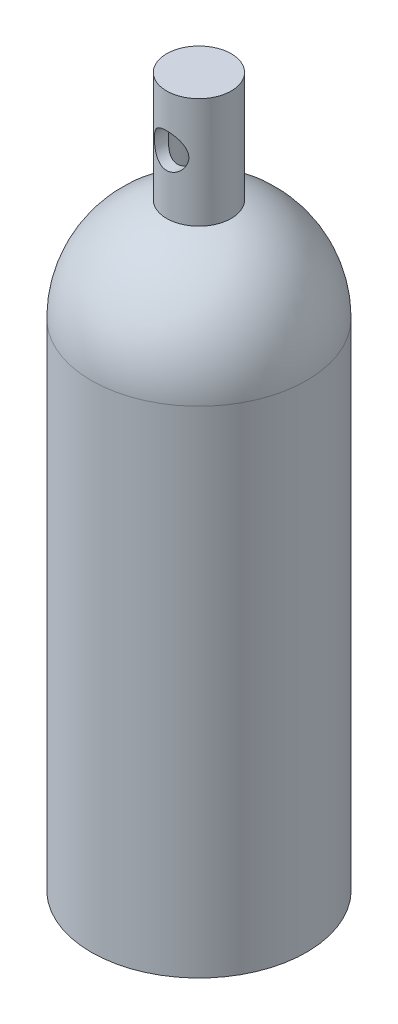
ISO-10303-21;
HEADER;
FILE_DESCRIPTION(('STEP AP214'),'2;1');
FILE_NAME('part.step','',(''),(''),'','','');
FILE_SCHEMA(('AUTOMOTIVE_DESIGN { 1 0 10303 214 1 1 1 1 }'));
ENDSEC;
DATA;
#1=APPLICATION_CONTEXT('core data for automotive mechanical design processes');
#2=APPLICATION_PROTOCOL_DEFINITION('international standard','automotive_design',2000,#1);
#3=PRODUCT_CONTEXT('',#1,'mechanical');
#4=PRODUCT('Part','Part','',(#3));
#5=PRODUCT_RELATED_PRODUCT_CATEGORY('part','',(#4));
#6=PRODUCT_DEFINITION_FORMATION('','',#4);
#7=PRODUCT_DEFINITION_CONTEXT('part definition',#1,'design');
#8=PRODUCT_DEFINITION('design','',#6,#7);
#9=PRODUCT_DEFINITION_SHAPE('','',#8);
#10=(LENGTH_UNIT() NAMED_UNIT(*) SI_UNIT(.MILLI.,.METRE.));
#11=(NAMED_UNIT(*) PLANE_ANGLE_UNIT() SI_UNIT($,.RADIAN.));
#12=(NAMED_UNIT(*) SI_UNIT($,.STERADIAN.) SOLID_ANGLE_UNIT());
#13=UNCERTAINTY_MEASURE_WITH_UNIT(LENGTH_MEASURE(1.E-05),#10,'distance_accuracy_value','');
#14=(GEOMETRIC_REPRESENTATION_CONTEXT(3) GLOBAL_UNCERTAINTY_ASSIGNED_CONTEXT((#13)) GLOBAL_UNIT_ASSIGNED_CONTEXT((#10,
#11,#12)) REPRESENTATION_CONTEXT('',''));
#15=CARTESIAN_POINT('',(0.,0.,0.));
#16=DIRECTION('',(0.,0.,1.));
#17=DIRECTION('',(1.,0.,0.));
#18=AXIS2_PLACEMENT_3D('',#15,#16,#17);
#19=CARTESIAN_POINT('',(0.,48.9897948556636,0.));
#20=DIRECTION('',(0.,-1.,0.));
#21=DIRECTION('',(0.,0.,-1.));
#22=AXIS2_PLACEMENT_3D('',#19,#20,#21);
#23=CYLINDRICAL_SURFACE('',#22,10.);
#24=CARTESIAN_POINT('',(0.,93.8748219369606,0.));
#25=DIRECTION('',(0.,-1.,0.));
#26=DIRECTION('',(0.,0.,-1.));
#27=AXIS2_PLACEMENT_3D('',#24,#25,#26);
#28=CIRCLE('',#27,10.);
#29=CARTESIAN_POINT('',(0.,93.8748219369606,-10.));
#30=VERTEX_POINT('',#29);
#31=EDGE_CURVE('E54',#30,#30,#28,.T.);
#32=ORIENTED_EDGE('',*,*,#31,.F.);
#33=EDGE_LOOP('',(#32));
#34=FACE_BOUND('',#33,.T.);
#35=CARTESIAN_POINT('',(0.,43.8748219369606,0.));
#36=DIRECTION('',(0.,-1.,0.));
#37=DIRECTION('',(0.,0.,-1.));
#38=AXIS2_PLACEMENT_3D('',#35,#36,#37);
#39=CIRCLE('',#38,10.);
#40=CARTESIAN_POINT('',(0.,43.8748219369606,-10.));
#41=VERTEX_POINT('',#40);
#42=EDGE_CURVE('E57',#41,#41,#39,.T.);
#43=ORIENTED_EDGE('',*,*,#42,.T.);
#44=EDGE_LOOP('',(#43));
#45=FACE_BOUND('',#44,.T.);
#46=CARTESIAN_POINT('',(-8.,75.,6.));
#47=CARTESIAN_POINT('',(-7.99999850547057,74.8497754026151,6.0000035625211));
#48=CARTESIAN_POINT('',(-7.99575712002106,74.6994958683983,6.00567011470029));
#49=CARTESIAN_POINT('',(-7.97889190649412,74.4001772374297,6.02805701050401));
#50=CARTESIAN_POINT('',(-7.96626236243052,74.2511390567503,6.04478489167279));
#51=CARTESIAN_POINT('',(-7.93287350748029,73.9551277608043,6.0885361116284));
#52=CARTESIAN_POINT('',(-7.9120936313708,73.8081608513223,6.11558548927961));
#53=CARTESIAN_POINT('',(-7.86281319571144,73.5174579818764,6.17881626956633));
#54=CARTESIAN_POINT('',(-7.83430749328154,73.3737242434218,6.21500375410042));
#55=CARTESIAN_POINT('',(-7.75884142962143,73.0407118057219,6.30913384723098));
#56=CARTESIAN_POINT('',(-7.70891139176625,72.8530054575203,6.37026382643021));
#57=CARTESIAN_POINT('',(-7.59693100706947,72.4853222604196,6.50339876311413));
#58=CARTESIAN_POINT('',(-7.53488026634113,72.3053456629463,6.57540407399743));
#59=CARTESIAN_POINT('',(-7.39933665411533,71.9527761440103,6.72757172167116));
#60=CARTESIAN_POINT('',(-7.32581587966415,71.7802025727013,6.80775378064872));
#61=CARTESIAN_POINT('',(-7.16807370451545,71.4428390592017,6.97365270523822));
#62=CARTESIAN_POINT('',(-7.08385257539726,71.2780489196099,7.05936943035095));
#63=CARTESIAN_POINT('',(-6.87278634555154,70.8978423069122,7.2659318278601));
#64=CARTESIAN_POINT('',(-6.74154128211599,70.685668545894,7.38827143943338));
#65=CARTESIAN_POINT('',(-6.4605520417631,70.2752644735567,7.63520125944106));
#66=CARTESIAN_POINT('',(-6.31080122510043,70.0770392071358,7.75979226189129));
#67=CARTESIAN_POINT('',(-5.99323431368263,69.6950230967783,8.00760160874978));
#68=CARTESIAN_POINT('',(-5.82543282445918,69.5112207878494,8.13082097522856));
#69=CARTESIAN_POINT('',(-5.47186088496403,69.1586797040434,8.37284997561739));
#70=CARTESIAN_POINT('',(-5.28609645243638,68.9899359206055,8.49166106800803));
#71=CARTESIAN_POINT('',(-4.93523769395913,68.7004412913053,8.69921771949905));
#72=CARTESIAN_POINT('',(-4.77330095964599,68.5767917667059,8.78926877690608));
#73=CARTESIAN_POINT('',(-4.43820831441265,68.3408500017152,8.96314223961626));
#74=CARTESIAN_POINT('',(-4.26505458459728,68.2285555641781,9.04696584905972));
#75=CARTESIAN_POINT('',(-3.90811229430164,68.0164692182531,9.20678289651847));
#76=CARTESIAN_POINT('',(-3.72433661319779,67.9166626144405,9.28278551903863));
#77=CARTESIAN_POINT('',(-3.34661343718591,67.7305792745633,9.42554592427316));
#78=CARTESIAN_POINT('',(-3.15266763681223,67.6443002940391,9.49230524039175));
#79=CARTESIAN_POINT('',(-2.7876899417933,67.4992754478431,9.60516255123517));
#80=CARTESIAN_POINT('',(-2.61802183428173,67.4383333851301,9.65285598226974));
#81=CARTESIAN_POINT('',(-2.27301580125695,67.3275683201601,9.73986819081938));
#82=CARTESIAN_POINT('',(-2.09767896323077,67.2777431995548,9.77918856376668));
#83=CARTESIAN_POINT('',(-1.74235286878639,67.1898984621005,9.84870372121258));
#84=CARTESIAN_POINT('',(-1.5623652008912,67.1518748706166,9.87890157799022));
#85=CARTESIAN_POINT('',(-1.19885362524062,67.088186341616,9.92957313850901));
#86=CARTESIAN_POINT('',(-1.01532967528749,67.0625215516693,9.95004672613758));
#87=CARTESIAN_POINT('',(-0.645442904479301,67.0239045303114,9.98087986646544));
#88=CARTESIAN_POINT('',(-0.459072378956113,67.0109972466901,9.99120365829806));
#89=CARTESIAN_POINT('',(-0.0855968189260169,66.9982762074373,10.0013783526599));
#90=CARTESIAN_POINT('',(0.101508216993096,66.9984624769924,10.0012292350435));
#91=CARTESIAN_POINT('',(0.474947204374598,67.0119252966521,9.99046151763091));
#92=CARTESIAN_POINT('',(0.661281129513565,67.0252022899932,9.97984256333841));
#93=CARTESIAN_POINT('',(1.0317009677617,67.0646182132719,9.94837390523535));
#94=CARTESIAN_POINT('',(1.21578693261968,67.0907568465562,9.92752443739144));
#95=CARTESIAN_POINT('',(1.5703554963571,67.1536881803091,9.8774625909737));
#96=CARTESIAN_POINT('',(1.74103055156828,67.1898181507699,9.84877142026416));
#97=CARTESIAN_POINT('',(2.07822216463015,67.2727010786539,9.7831747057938));
#98=CARTESIAN_POINT('',(2.24473728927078,67.3194576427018,9.7462663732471));
#99=CARTESIAN_POINT('',(2.57267278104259,67.4230012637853,9.6648788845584));
#100=CARTESIAN_POINT('',(2.73409423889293,67.4797861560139,9.62040136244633));
#101=CARTESIAN_POINT('',(3.05123215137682,67.6027744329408,9.52457183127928));
#102=CARTESIAN_POINT('',(3.20694649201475,67.6689812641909,9.47321730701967));
#103=CARTESIAN_POINT('',(3.69392962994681,67.8943339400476,9.29950002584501));
#104=CARTESIAN_POINT('',(4.01344906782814,68.0702713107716,9.16540055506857));
#105=CARTESIAN_POINT('',(4.6189053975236,68.4581862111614,8.87573180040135));
#106=CARTESIAN_POINT('',(4.90482333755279,68.670183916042,8.72015050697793));
#107=CARTESIAN_POINT('',(5.33520078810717,69.0350443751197,8.45999310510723));
#108=CARTESIAN_POINT('',(5.49079696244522,69.1780231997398,8.35965425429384));
#109=CARTESIAN_POINT('',(5.78920834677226,69.474665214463,8.15583787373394));
#110=CARTESIAN_POINT('',(5.93202522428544,69.6283270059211,8.05236075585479));
#111=CARTESIAN_POINT('',(6.20495908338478,69.9460501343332,7.84397882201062));
#112=CARTESIAN_POINT('',(6.33505914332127,70.1101248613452,7.73907230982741));
#113=CARTESIAN_POINT('',(6.5822031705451,70.4482474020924,7.52999230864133));
#114=CARTESIAN_POINT('',(6.69924870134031,70.6222940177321,7.4258187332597));
#115=CARTESIAN_POINT('',(6.9093849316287,70.9631054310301,7.2304188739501));
#116=CARTESIAN_POINT('',(7.00369709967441,71.1289562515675,7.13891215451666));
#117=CARTESIAN_POINT('',(7.18111377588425,71.4689399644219,6.96041905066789));
#118=CARTESIAN_POINT('',(7.26421700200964,71.6430738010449,6.87343318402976));
#119=CARTESIAN_POINT('',(7.41852221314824,71.9994762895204,6.70659513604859));
#120=CARTESIAN_POINT('',(7.48974437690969,72.1817304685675,6.62673096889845));
#121=CARTESIAN_POINT('',(7.61961784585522,72.5545091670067,6.4769774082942));
#122=CARTESIAN_POINT('',(7.67827490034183,72.7450298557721,6.40708345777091));
#123=CARTESIAN_POINT('',(7.802468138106,73.2111181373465,6.25576307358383));
#124=CARTESIAN_POINT('',(7.8616140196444,73.4906268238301,6.18063735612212));
#125=CARTESIAN_POINT('',(7.9278570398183,73.9183623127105,6.09510929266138));
#126=CARTESIAN_POINT('',(7.94618750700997,74.0622577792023,6.07113338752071));
#127=CARTESIAN_POINT('',(7.97505562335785,74.3521769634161,6.03316408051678));
#128=CARTESIAN_POINT('',(7.98559344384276,74.4982006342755,6.0191704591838));
#129=CARTESIAN_POINT('',(7.99865927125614,74.7921050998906,6.00179727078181));
#130=CARTESIAN_POINT('',(8.00113968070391,74.9399917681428,5.9984807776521));
#131=CARTESIAN_POINT('',(7.99789775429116,75.2355108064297,6.00280253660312));
#132=CARTESIAN_POINT('',(7.99217554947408,75.3831431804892,6.01044061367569));
#133=CARTESIAN_POINT('',(7.97265920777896,75.6770696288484,6.03630380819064));
#134=CARTESIAN_POINT('',(7.95885728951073,75.8233622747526,6.05453913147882));
#135=CARTESIAN_POINT('',(7.92347678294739,76.1135074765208,6.10076688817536));
#136=CARTESIAN_POINT('',(7.90189335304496,76.2573584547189,6.12876539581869));
#137=CARTESIAN_POINT('',(7.84493960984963,76.5778827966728,6.2015776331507));
#138=CARTESIAN_POINT('',(7.80746054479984,76.7536214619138,6.24885548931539));
#139=CARTESIAN_POINT('',(7.72176071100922,77.0990772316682,6.35444912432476));
#140=CARTESIAN_POINT('',(7.67353454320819,77.268791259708,6.41277044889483));
#141=CARTESIAN_POINT('',(7.56699838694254,77.6021589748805,6.53814287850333));
#142=CARTESIAN_POINT('',(7.50866488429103,77.7657974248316,6.60521424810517));
#143=CARTESIAN_POINT('',(7.38261988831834,78.086521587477,6.74580211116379));
#144=CARTESIAN_POINT('',(7.31490797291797,78.2436070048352,6.81931889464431));
#145=CARTESIAN_POINT('',(7.13750913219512,78.6217926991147,7.00565515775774));
#146=CARTESIAN_POINT('',(7.02279764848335,78.8392749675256,7.12105902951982));
#147=CARTESIAN_POINT('',(6.77531704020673,79.2608504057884,7.35692533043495));
#148=CARTESIAN_POINT('',(6.64254050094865,79.4649380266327,7.47738982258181));
#149=CARTESIAN_POINT('',(6.35927652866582,79.8599080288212,7.71973997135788));
#150=CARTESIAN_POINT('',(6.20877175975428,80.0507771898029,7.84162691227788));
#151=CARTESIAN_POINT('',(5.89040753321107,80.4186955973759,8.0835060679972));
#152=CARTESIAN_POINT('',(5.72255079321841,80.5957470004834,8.20349857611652));
#153=CARTESIAN_POINT('',(5.36706505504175,80.9377014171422,8.44043213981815));
#154=CARTESIAN_POINT('',(5.1791870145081,81.1023937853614,8.55730475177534));
#155=CARTESIAN_POINT('',(4.785885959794,81.4154862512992,8.78332155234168));
#156=CARTESIAN_POINT('',(4.58046020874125,81.5638837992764,8.89246453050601));
#157=CARTESIAN_POINT('',(4.15319348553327,81.8422078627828,9.09984753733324));
#158=CARTESIAN_POINT('',(3.93139916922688,81.9721840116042,9.19811670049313));
#159=CARTESIAN_POINT('',(3.47195618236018,82.211973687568,9.38118171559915));
#160=CARTESIAN_POINT('',(3.2343165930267,82.3217986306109,9.46598519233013));
#161=CARTESIAN_POINT('',(2.82388510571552,82.4871649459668,9.59457595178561));
#162=CARTESIAN_POINT('',(2.65489537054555,82.5487903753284,9.64277093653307));
#163=CARTESIAN_POINT('',(2.31120271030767,82.6610048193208,9.73086759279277));
#164=CARTESIAN_POINT('',(2.13650128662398,82.7115967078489,9.77077142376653));
#165=CARTESIAN_POINT('',(1.78241638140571,82.8010460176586,9.84152279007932));
#166=CARTESIAN_POINT('',(1.60303543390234,82.8399096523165,9.87237512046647));
#167=CARTESIAN_POINT('',(1.24064885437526,82.9053581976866,9.92442915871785));
#168=CARTESIAN_POINT('',(1.05764309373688,82.931942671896,9.94563052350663));
#169=CARTESIAN_POINT('',(0.688660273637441,82.9724725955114,9.97798423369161));
#170=CARTESIAN_POINT('',(0.502674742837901,82.9863710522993,9.98909921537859));
#171=CARTESIAN_POINT('',(0.129854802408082,83.0011211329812,10.0008959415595));
#172=CARTESIAN_POINT('',(-0.0569796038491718,83.0019728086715,10.0015777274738));
#173=CARTESIAN_POINT('',(-0.430005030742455,82.9906144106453,9.99249254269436));
#174=CARTESIAN_POINT('',(-0.616196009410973,82.9784035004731,9.98272490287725));
#175=CARTESIAN_POINT('',(-0.986452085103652,82.9411291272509,9.95295966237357));
#176=CARTESIAN_POINT('',(-1.17051722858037,82.9160659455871,9.93296228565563));
#177=CARTESIAN_POINT('',(-1.52534233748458,82.8551876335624,9.8845158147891));
#178=CARTESIAN_POINT('',(-1.69628523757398,82.8200237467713,9.85657949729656));
#179=CARTESIAN_POINT('',(-2.03409736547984,82.7390329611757,9.79244708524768));
#180=CARTESIAN_POINT('',(-2.20096518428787,82.6932024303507,9.75624817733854));
#181=CARTESIAN_POINT('',(-2.52967809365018,82.5914635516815,9.67622501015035));
#182=CARTESIAN_POINT('',(-2.69152422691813,82.5355573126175,9.63240234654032));
#183=CARTESIAN_POINT('',(-3.0095687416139,82.4142767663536,9.53782297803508));
#184=CARTESIAN_POINT('',(-3.16576502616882,82.3488989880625,9.48706373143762));
#185=CARTESIAN_POINT('',(-3.65335383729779,82.1265696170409,9.31549846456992));
#186=CARTESIAN_POINT('',(-3.97317038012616,81.9528590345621,9.18292546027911));
#187=CARTESIAN_POINT('',(-4.57952585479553,81.5693962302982,8.89610624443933));
#188=CARTESIAN_POINT('',(-4.86604698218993,81.3596248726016,8.74184853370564));
#189=CARTESIAN_POINT('',(-5.29741387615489,80.9985116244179,8.48370075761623));
#190=CARTESIAN_POINT('',(-5.45332719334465,80.8570593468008,8.38414331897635));
#191=CARTESIAN_POINT('',(-5.75249575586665,80.563515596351,8.18177144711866));
#192=CARTESIAN_POINT('',(-5.89575262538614,80.4114254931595,8.07895743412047));
#193=CARTESIAN_POINT('',(-6.16969303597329,80.096905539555,7.87174853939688));
#194=CARTESIAN_POINT('',(-6.30035965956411,79.9344622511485,7.76735174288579));
#195=CARTESIAN_POINT('',(-6.54877096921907,79.5996786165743,7.55909083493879));
#196=CARTESIAN_POINT('',(-6.66651708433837,79.4273393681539,7.45522666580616));
#197=CARTESIAN_POINT('',(-6.87986147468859,79.0871138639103,7.25856879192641));
#198=CARTESIAN_POINT('',(-6.97648055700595,78.9199928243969,7.165558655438));
#199=CARTESIAN_POINT('',(-7.15826985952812,78.5772620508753,6.98395832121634));
#200=CARTESIAN_POINT('',(-7.24343854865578,78.4016511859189,6.89536871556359));
#201=CARTESIAN_POINT('',(-7.40164833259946,78.0420612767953,6.72525646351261));
#202=CARTESIAN_POINT('',(-7.4747060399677,77.8580941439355,6.64372421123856));
#203=CARTESIAN_POINT('',(-7.60800017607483,77.4815662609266,6.49065712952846));
#204=CARTESIAN_POINT('',(-7.66824305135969,77.2890098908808,6.41911727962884));
#205=CARTESIAN_POINT('',(-7.75905938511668,76.9538634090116,6.30876338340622));
#206=CARTESIAN_POINT('',(-7.79313760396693,76.8133451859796,6.26652916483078));
#207=CARTESIAN_POINT('',(-7.85395376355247,76.5285901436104,6.1901369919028));
#208=CARTESIAN_POINT('',(-7.88069427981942,76.3843546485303,6.15597620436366));
#209=CARTESIAN_POINT('',(-7.92632124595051,76.0931966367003,6.09711565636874));
#210=CARTESIAN_POINT('',(-7.94523144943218,75.9462836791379,6.07238730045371));
#211=CARTESIAN_POINT('',(-7.97490856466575,75.6503195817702,6.03336100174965));
#212=CARTESIAN_POINT('',(-7.98568117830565,75.5012700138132,6.01905575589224));
#213=CARTESIAN_POINT('',(-7.99483909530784,75.2932366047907,6.00687605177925));
#214=CARTESIAN_POINT('',(-7.99677323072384,75.2346425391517,6.00430035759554));
#215=CARTESIAN_POINT('',(-7.99935405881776,75.1173684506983,6.00086152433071));
#216=CARTESIAN_POINT('',(-8.00000058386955,75.0586884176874,5.99999860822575));
#217=CARTESIAN_POINT('',(-8.,75.,6.));
#218=B_SPLINE_CURVE_WITH_KNOTS('',3,(#46,#47,#48,#49,#50,#51,#52,#53,#54,#55,#56,#57,#58,#59,
#60,#61,#62,#63,#64,#65,#66,#67,#68,#69,#70,#71,#72,#73,#74,#75,#76,#77,#78,#79,#80,#81,#82,#83,
#84,#85,#86,#87,#88,#89,#90,#91,#92,#93,#94,#95,#96,#97,#98,#99,#100,#101,#102,#103,#104,#105,
#106,#107,#108,#109,#110,#111,#112,#113,#114,#115,#116,#117,#118,#119,#120,#121,#122,#123,#124,
#125,#126,#127,#128,#129,#130,#131,#132,#133,#134,#135,#136,#137,#138,#139,#140,#141,#142,#143,
#144,#145,#146,#147,#148,#149,#150,#151,#152,#153,#154,#155,#156,#157,#158,#159,#160,#161,#162,
#163,#164,#165,#166,#167,#168,#169,#170,#171,#172,#173,#174,#175,#176,#177,#178,#179,#180,#181,
#182,#183,#184,#185,#186,#187,#188,#189,#190,#191,#192,#193,#194,#195,#196,#197,#198,#199,#200,
#201,#202,#203,#204,#205,#206,#207,#208,#209,#210,#211,#212,#213,#214,#215,#216,#217),
.UNSPECIFIED.,.T.,.F.,(4,2,2,2,2,2,2,2,2,2,2,2,2,2,2,2,2,2,2,2,2,2,2,2,2,2,2,2,2,2,2,2,2,2,2,2,
2,2,2,2,2,2,2,2,2,2,2,2,2,2,2,2,2,2,2,2,2,2,2,2,2,2,2,2,2,2,2,2,2,2,2,2,2,2,2,2,2,2,2,2,2,2,2,2,
2,4),(0.,0.450606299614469,0.901519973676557,1.35357880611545,1.8059393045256,2.41584789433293,
3.0257763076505,3.63721230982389,4.24863279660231,5.08116194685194,5.91399067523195,
6.74615052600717,7.57803255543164,8.24571319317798,8.91326439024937,9.58002248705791,
10.2466698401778,10.8055557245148,11.3643350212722,11.9229259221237,12.4815234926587,
13.0420821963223,13.6026419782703,14.1632207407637,14.7237865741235,15.2536171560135,
15.7836278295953,16.3135242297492,16.8436149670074,18.0049267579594,19.1668904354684,
19.8681109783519,20.5692398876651,21.2712894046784,21.9732547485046,22.6075897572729,
23.2419972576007,23.875316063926,24.5083444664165,25.3907054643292,25.8313204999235,
26.2719258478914,26.7151292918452,27.1583256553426,27.6019495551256,28.0458499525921,
28.6024005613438,29.1592313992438,29.717375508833,30.2755447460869,31.0892572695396,
31.9033047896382,32.7181550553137,33.5328778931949,34.3592852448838,35.185821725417,
36.0100870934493,36.8338840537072,37.3920107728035,37.9499919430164,38.5076769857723,
39.0653818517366,39.6251443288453,40.1849045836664,40.7447006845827,41.3044845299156,
41.8341418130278,42.363979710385,42.89370684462,43.4236286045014,44.5810964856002,
45.7391804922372,46.4372454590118,47.1352207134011,47.8341211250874,48.5329441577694,
49.1753059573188,49.8177535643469,50.4593125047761,51.1005479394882,51.5520690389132,
52.0034314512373,52.453414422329,52.9030818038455,53.0790977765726,53.255136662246),.UNSPECIFIED.);
#219=CARTESIAN_POINT('',(-8.,75.,6.));
#220=VERTEX_POINT('',#219);
#221=EDGE_CURVE('E70',#220,#220,#218,.T.);
#222=ORIENTED_EDGE('',*,*,#221,.T.);
#223=EDGE_LOOP('',(#222));
#224=FACE_BOUND('',#223,.T.);
#225=ADVANCED_FACE('F33',(#34,#45,#224),#23,.F.);
#226=CARTESIAN_POINT('',(0.,-230.,0.));
#227=DIRECTION('',(0.,1.,0.));
#228=DIRECTION('',(0.,0.,1.));
#229=AXIS2_PLACEMENT_3D('',#226,#227,#228);
#230=CYLINDRICAL_SURFACE('',#229,45.);
#231=CARTESIAN_POINT('',(0.,-225.,0.));
#232=DIRECTION('',(0.,1.,0.));
#233=DIRECTION('',(0.,0.,1.));
#234=AXIS2_PLACEMENT_3D('',#231,#232,#233);
#235=CIRCLE('',#234,45.);
#236=CARTESIAN_POINT('',(0.,-225.,45.));
#237=VERTEX_POINT('',#236);
#238=EDGE_CURVE('E44',#237,#237,#235,.T.);
#239=ORIENTED_EDGE('',*,*,#238,.F.);
#240=EDGE_LOOP('',(#239));
#241=FACE_BOUND('',#240,.T.);
#242=CARTESIAN_POINT('',(0.,0.,0.));
#243=DIRECTION('',(0.,-1.,0.));
#244=DIRECTION('',(0.,0.,-1.));
#245=AXIS2_PLACEMENT_3D('',#242,#243,#244);
#246=CIRCLE('',#245,45.);
#247=CARTESIAN_POINT('',(0.,0.,-45.));
#248=VERTEX_POINT('',#247);
#249=EDGE_CURVE('E60',#248,#248,#246,.T.);
#250=ORIENTED_EDGE('',*,*,#249,.F.);
#251=EDGE_LOOP('',(#250));
#252=FACE_BOUND('',#251,.T.);
#253=ADVANCED_FACE('F90',(#241,#252),#230,.F.);
#254=CARTESIAN_POINT('',(0.,-225.,0.));
#255=DIRECTION('',(0.,1.,0.));
#256=DIRECTION('',(0.,0.,1.));
#257=AXIS2_PLACEMENT_3D('',#254,#255,#256);
#258=PLANE('',#257);
#259=ORIENTED_EDGE('',*,*,#238,.T.);
#260=EDGE_LOOP('',(#259));
#261=FACE_BOUND('',#260,.T.);
#262=ADVANCED_FACE('F94',(#261),#258,.T.);
#263=CARTESIAN_POINT('',(0.,93.8748219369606,0.));
#264=DIRECTION('',(0.,1.,0.));
#265=DIRECTION('',(0.,0.,1.));
#266=AXIS2_PLACEMENT_3D('',#263,#264,#265);
#267=PLANE('',#266);
#268=ORIENTED_EDGE('',*,*,#31,.T.);
#269=EDGE_LOOP('',(#268));
#270=FACE_BOUND('',#269,.T.);
#271=ADVANCED_FACE('F86',(#270),#267,.F.);
#272=CARTESIAN_POINT('',(0.,0.,0.));
#273=DIRECTION('',(0.,-1.,0.));
#274=DIRECTION('',(0.,0.,1.));
#275=AXIS2_PLACEMENT_3D('',#272,#273,#274);
#276=SPHERICAL_SURFACE('',#275,45.);
#277=ORIENTED_EDGE('',*,*,#42,.F.);
#278=EDGE_LOOP('',(#277));
#279=FACE_BOUND('',#278,.T.);
#280=ORIENTED_EDGE('',*,*,#249,.T.);
#281=EDGE_LOOP('',(#280));
#282=FACE_BOUND('',#281,.T.);
#283=ADVANCED_FACE('F81',(#279,#282),#276,.F.);
#284=CARTESIAN_POINT('',(0.,75.,50.001));
#285=DIRECTION('',(0.,0.,-1.));
#286=DIRECTION('',(-1.,0.,0.));
#287=AXIS2_PLACEMENT_3D('',#284,#285,#286);
#288=CYLINDRICAL_SURFACE('',#287,8.);
#289=ORIENTED_EDGE('',*,*,#221,.F.);
#290=EDGE_LOOP('',(#289));
#291=FACE_BOUND('',#290,.T.);
#292=CARTESIAN_POINT('',(-8.,75.,12.6885775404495));
#293=CARTESIAN_POINT('',(-8.00000082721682,75.2062807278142,12.6885765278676));
#294=CARTESIAN_POINT('',(-7.99201174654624,75.4125521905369,12.6936244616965));
#295=CARTESIAN_POINT('',(-7.96017537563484,75.8234599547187,12.7136132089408));
#296=CARTESIAN_POINT('',(-7.93632212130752,76.0280956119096,12.728557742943));
#297=CARTESIAN_POINT('',(-7.87306095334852,76.4343029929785,12.7677833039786));
#298=CARTESIAN_POINT('',(-7.83363262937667,76.6358703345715,12.7920765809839));
#299=CARTESIAN_POINT('',(-7.73973085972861,77.0343271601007,12.8491080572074));
#300=CARTESIAN_POINT('',(-7.68525075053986,77.2312145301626,12.8818499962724));
#301=CARTESIAN_POINT('',(-7.56228385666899,77.617774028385,12.9544169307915));
#302=CARTESIAN_POINT('',(-7.49388888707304,77.8074842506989,12.9941952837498));
#303=CARTESIAN_POINT('',(-7.3435222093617,78.1801055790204,13.0797616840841));
#304=CARTESIAN_POINT('',(-7.26154553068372,78.363014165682,13.125551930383));
#305=CARTESIAN_POINT('',(-7.0846895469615,78.7211610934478,13.2218490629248));
#306=CARTESIAN_POINT('',(-6.9898120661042,78.8964005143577,13.2723552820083));
#307=CARTESIAN_POINT('',(-6.78781438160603,79.2385247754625,13.3767912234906));
#308=CARTESIAN_POINT('',(-6.68069376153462,79.4054093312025,13.4307210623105));
#309=CARTESIAN_POINT('',(-6.32032913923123,79.9234942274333,13.6062056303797));
#310=CARTESIAN_POINT('',(-6.04463813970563,80.2582015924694,13.7320055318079));
#311=CARTESIAN_POINT('',(-5.59347847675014,80.7236252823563,13.9190407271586));
#312=CARTESIAN_POINT('',(-5.43671146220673,80.8727421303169,13.98114670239));
#313=CARTESIAN_POINT('',(-5.11109924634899,81.1582050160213,14.1034342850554));
#314=CARTESIAN_POINT('',(-4.94225210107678,81.29454899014,14.1636155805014));
#315=CARTESIAN_POINT('',(-4.57935642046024,81.5638830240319,14.2852717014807));
#316=CARTESIAN_POINT('',(-4.38437188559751,81.6957394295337,14.3464672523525));
#317=CARTESIAN_POINT('',(-3.98237404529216,81.9423529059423,14.463211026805));
#318=CARTESIAN_POINT('',(-3.77536600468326,82.0571173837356,14.5187616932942));
#319=CARTESIAN_POINT('',(-3.35057394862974,82.2684185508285,14.6226346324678));
#320=CARTESIAN_POINT('',(-3.13279317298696,82.364960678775,14.6709590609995));
#321=CARTESIAN_POINT('',(-2.68795642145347,82.5386923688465,14.7589385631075));
#322=CARTESIAN_POINT('',(-2.46090159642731,82.6158843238,14.7985947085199));
#323=CARTESIAN_POINT('',(-2.017636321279,82.744553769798,14.8652391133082));
#324=CARTESIAN_POINT('',(-1.80198906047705,82.7975824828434,14.8929813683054));
#325=CARTESIAN_POINT('',(-1.36607301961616,82.8856372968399,14.9392726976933));
#326=CARTESIAN_POINT('',(-1.14580446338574,82.9206642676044,14.9578222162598));
#327=CARTESIAN_POINT('',(-0.702641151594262,82.9722035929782,14.9851777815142));
#328=CARTESIAN_POINT('',(-0.479748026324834,82.9887268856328,14.9939895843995));
#329=CARTESIAN_POINT('',(-0.0331964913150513,83.0030487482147,15.0016248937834));
#330=CARTESIAN_POINT('',(0.190461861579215,83.0008486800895,15.0004491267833));
#331=CARTESIAN_POINT('',(0.614471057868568,82.9789062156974,14.9887583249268));
#332=CARTESIAN_POINT('',(0.81494147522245,82.9609184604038,14.9791774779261));
#333=CARTESIAN_POINT('',(1.21344088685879,82.9099877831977,14.9521717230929));
#334=CARTESIAN_POINT('',(1.41146986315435,82.8770447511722,14.9347467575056));
#335=CARTESIAN_POINT('',(1.80372417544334,82.7965804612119,14.8924644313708));
#336=CARTESIAN_POINT('',(1.99794954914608,82.7490593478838,14.8676071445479));
#337=CARTESIAN_POINT('',(2.3813778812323,82.6399461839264,14.811029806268));
#338=CARTESIAN_POINT('',(2.57058064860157,82.5783535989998,14.7793094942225));
#339=CARTESIAN_POINT('',(2.94506910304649,82.440887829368,14.7092919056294));
#340=CARTESIAN_POINT('',(3.1302827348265,82.3648554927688,14.6709217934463));
#341=CARTESIAN_POINT('',(3.49352300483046,82.1996629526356,14.5886953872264));
#342=CARTESIAN_POINT('',(3.67154724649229,82.1104984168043,14.5448372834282));
#343=CARTESIAN_POINT('',(4.19348838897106,81.8243650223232,14.4063856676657));
#344=CARTESIAN_POINT('',(4.52549971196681,81.6086725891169,14.3048709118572));
#345=CARTESIAN_POINT('',(5.1845632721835,81.1081019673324,14.0802637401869));
#346=CARTESIAN_POINT('',(5.50754077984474,80.8183719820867,13.9560254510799));
#347=CARTESIAN_POINT('',(5.95360340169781,80.3480315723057,13.7688338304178));
#348=CARTESIAN_POINT('',(6.0959904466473,80.1851468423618,13.7062463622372));
#349=CARTESIAN_POINT('',(6.36737369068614,79.8480258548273,13.5822961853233));
#350=CARTESIAN_POINT('',(6.49636768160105,79.6737877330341,13.5209336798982));
#351=CARTESIAN_POINT('',(6.74990405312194,79.3004300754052,13.3962802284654));
#352=CARTESIAN_POINT('',(6.87327380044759,79.1004340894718,13.3332248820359));
#353=CARTESIAN_POINT('',(7.10248719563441,78.6891810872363,13.2125488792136));
#354=CARTESIAN_POINT('',(7.2083387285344,78.4779291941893,13.154925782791));
#355=CARTESIAN_POINT('',(7.40146247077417,78.0453911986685,13.0472441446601));
#356=CARTESIAN_POINT('',(7.48874671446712,77.8241117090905,12.9971807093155));
#357=CARTESIAN_POINT('',(7.64370915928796,77.3728854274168,12.9066564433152));
#358=CARTESIAN_POINT('',(7.71139038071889,77.1429399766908,12.8661941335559));
#359=CARTESIAN_POINT('',(7.82145437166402,76.695173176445,12.7995566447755));
#360=CARTESIAN_POINT('',(7.86544291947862,76.4778796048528,12.7724893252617));
#361=CARTESIAN_POINT('',(7.93530677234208,76.0393230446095,12.7292029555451));
#362=CARTESIAN_POINT('',(7.96118319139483,75.8180603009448,12.7129832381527));
#363=CARTESIAN_POINT('',(7.99436472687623,75.3737830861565,12.6921440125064));
#364=CARTESIAN_POINT('',(8.00168522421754,75.1507702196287,12.6875148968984));
#365=CARTESIAN_POINT('',(7.99766461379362,74.7049912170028,12.6900500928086));
#366=CARTESIAN_POINT('',(7.98632523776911,74.4822250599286,12.6972133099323));
#367=CARTESIAN_POINT('',(7.94793800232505,74.0685944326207,12.7212695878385));
#368=CARTESIAN_POINT('',(7.92318043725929,73.877428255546,12.7367415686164));
#369=CARTESIAN_POINT('',(7.86010987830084,73.498120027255,12.7757602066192));
#370=CARTESIAN_POINT('',(7.82179249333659,73.3099789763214,12.7993094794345));
#371=CARTESIAN_POINT('',(7.73205060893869,72.9379596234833,12.8537208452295));
#372=CARTESIAN_POINT('',(7.68062708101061,72.7540810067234,12.8845823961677));
#373=CARTESIAN_POINT('',(7.56517167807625,72.3914756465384,12.9527088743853));
#374=CARTESIAN_POINT('',(7.50113476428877,72.2127509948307,12.9899763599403));
#375=CARTESIAN_POINT('',(7.35794410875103,71.8536291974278,13.0716388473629));
#376=CARTESIAN_POINT('',(7.27825059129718,71.6735024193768,13.1162747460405));
#377=CARTESIAN_POINT('',(7.10633908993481,71.3205301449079,13.2102058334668));
#378=CARTESIAN_POINT('',(7.01411693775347,71.1476870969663,13.2595025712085));
#379=CARTESIAN_POINT('',(6.81773611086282,70.80993506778,13.3615387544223));
#380=CARTESIAN_POINT('',(6.71357466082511,70.6450279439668,13.4142789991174));
#381=CARTESIAN_POINT('',(6.49387939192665,70.3237397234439,13.5220005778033));
#382=CARTESIAN_POINT('',(6.37834479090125,70.1673592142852,13.5769820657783));
#383=CARTESIAN_POINT('',(6.11858240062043,69.8412631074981,13.6962134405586));
#384=CARTESIAN_POINT('',(5.97263494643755,69.6729766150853,13.7606355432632));
#385=CARTESIAN_POINT('',(5.6671719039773,69.349095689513,13.8892269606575));
#386=CARTESIAN_POINT('',(5.50765574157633,69.1935017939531,13.9533962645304));
#387=CARTESIAN_POINT('',(5.17570667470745,68.8957565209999,14.0799012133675));
#388=CARTESIAN_POINT('',(5.00326794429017,68.7536112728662,14.1422360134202));
#389=CARTESIAN_POINT('',(4.64630001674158,68.4837150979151,14.2634999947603));
#390=CARTESIAN_POINT('',(4.46176926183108,68.3559660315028,14.3224287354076));
#391=CARTESIAN_POINT('',(4.0735448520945,68.1107970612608,14.4377604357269));
#392=CARTESIAN_POINT('',(3.86937210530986,67.9940349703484,14.4939538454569));
#393=CARTESIAN_POINT('',(3.45019516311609,67.7783884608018,14.5994119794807));
#394=CARTESIAN_POINT('',(3.2351961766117,67.6794955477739,14.6486799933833));
#395=CARTESIAN_POINT('',(2.7958660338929,67.5007106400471,14.7388392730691));
#396=CARTESIAN_POINT('',(2.57153999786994,67.4208083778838,14.7797350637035));
#397=CARTESIAN_POINT('',(2.11523636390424,67.2810176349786,14.8519055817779));
#398=CARTESIAN_POINT('',(1.88325983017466,67.2211263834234,14.8831816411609));
#399=CARTESIAN_POINT('',(1.43696201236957,67.127142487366,14.9325301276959));
#400=CARTESIAN_POINT('',(1.22316354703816,67.0910842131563,14.9516024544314));
#401=CARTESIAN_POINT('',(0.792732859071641,67.0364187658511,14.980590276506));
#402=CARTESIAN_POINT('',(0.576100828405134,67.0178104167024,14.9905063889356));
#403=CARTESIAN_POINT('',(0.141899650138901,66.9983078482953,15.0009003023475));
#404=CARTESIAN_POINT('',(-0.0756691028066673,66.9974067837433,15.0013817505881));
#405=CARTESIAN_POINT('',(-0.509967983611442,67.0133146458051,14.9929015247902));
#406=CARTESIAN_POINT('',(-0.726698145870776,67.0301228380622,14.9839402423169));
#407=CARTESIAN_POINT('',(-1.13993624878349,67.0791255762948,14.9579364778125));
#408=CARTESIAN_POINT('',(-1.33665343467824,67.1099553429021,14.9416116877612));
#409=CARTESIAN_POINT('',(-1.72658766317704,67.1860147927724,14.9015877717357));
#410=CARTESIAN_POINT('',(-1.91980350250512,67.2312493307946,14.8778861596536));
#411=CARTESIAN_POINT('',(-2.30138685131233,67.3356190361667,14.8236550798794));
#412=CARTESIAN_POINT('',(-2.48975583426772,67.3947499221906,14.7931277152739));
#413=CARTESIAN_POINT('',(-2.86070279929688,67.5263710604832,14.7258931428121));
#414=CARTESIAN_POINT('',(-3.04327852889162,67.5988664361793,14.6891835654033));
#415=CARTESIAN_POINT('',(-3.40831874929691,67.7595166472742,14.6088870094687));
#416=CARTESIAN_POINT('',(-3.59052521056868,67.8481546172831,14.5650946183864));
#417=CARTESIAN_POINT('',(-3.94680147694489,68.0384224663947,14.4726171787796));
#418=CARTESIAN_POINT('',(-4.1208682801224,68.1400570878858,14.4239303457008));
#419=CARTESIAN_POINT('',(-4.46007274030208,68.3555935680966,14.3226773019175));
#420=CARTESIAN_POINT('',(-4.62520918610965,68.4694970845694,14.27011056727));
#421=CARTESIAN_POINT('',(-4.94589577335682,68.7088825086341,14.1621589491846));
#422=CARTESIAN_POINT('',(-5.10144513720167,68.8343653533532,14.1067738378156));
#423=CARTESIAN_POINT('',(-5.41899884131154,69.1107293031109,13.9880757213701));
#424=CARTESIAN_POINT('',(-5.57982089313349,69.2628850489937,13.9245623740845));
#425=CARTESIAN_POINT('',(-5.88822197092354,69.5798754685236,13.7969814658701));
#426=CARTESIAN_POINT('',(-6.03579980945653,69.7447112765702,13.7329138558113));
#427=CARTESIAN_POINT('',(-6.31714795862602,70.0864794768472,13.6057891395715));
#428=CARTESIAN_POINT('',(-6.45090273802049,70.2634251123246,13.5427332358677));
#429=CARTESIAN_POINT('',(-6.70365634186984,70.6284699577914,13.4194175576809));
#430=CARTESIAN_POINT('',(-6.82265601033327,70.81656852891,13.3591576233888));
#431=CARTESIAN_POINT('',(-7.05111918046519,71.2135816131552,13.2400605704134));
#432=CARTESIAN_POINT('',(-7.1597181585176,71.4230717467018,13.1814769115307));
#433=CARTESIAN_POINT('',(-7.35859675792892,71.8524556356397,13.0714949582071));
#434=CARTESIAN_POINT('',(-7.4488732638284,72.0723511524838,13.0200978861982));
#435=CARTESIAN_POINT('',(-7.60975396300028,72.5204548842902,12.926727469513));
#436=CARTESIAN_POINT('',(-7.68041349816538,72.7486376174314,12.8847276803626));
#437=CARTESIAN_POINT('',(-7.80129547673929,73.2119704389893,12.8119002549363));
#438=CARTESIAN_POINT('',(-7.85153144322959,73.4471158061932,12.7810652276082));
#439=CARTESIAN_POINT('',(-7.92721566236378,73.9011687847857,12.7342469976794));
#440=CARTESIAN_POINT('',(-7.95446803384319,74.1196655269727,12.7171886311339));
#441=CARTESIAN_POINT('',(-7.99086010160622,74.5587783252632,12.6943542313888));
#442=CARTESIAN_POINT('',(-7.99999911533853,74.7793944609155,12.6885786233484));
#443=CARTESIAN_POINT('',(-8.,75.,12.6885775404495));
#444=B_SPLINE_CURVE_WITH_KNOTS('',3,(#292,#293,#294,#295,#296,#297,#298,#299,#300,#301,#302,
#303,#304,#305,#306,#307,#308,#309,#310,#311,#312,#313,#314,#315,#316,#317,#318,#319,#320,#321,
#322,#323,#324,#325,#326,#327,#328,#329,#330,#331,#332,#333,#334,#335,#336,#337,#338,#339,#340,
#341,#342,#343,#344,#345,#346,#347,#348,#349,#350,#351,#352,#353,#354,#355,#356,#357,#358,#359,
#360,#361,#362,#363,#364,#365,#366,#367,#368,#369,#370,#371,#372,#373,#374,#375,#376,#377,#378,
#379,#380,#381,#382,#383,#384,#385,#386,#387,#388,#389,#390,#391,#392,#393,#394,#395,#396,#397,
#398,#399,#400,#401,#402,#403,#404,#405,#406,#407,#408,#409,#410,#411,#412,#413,#414,#415,#416,
#417,#418,#419,#420,#421,#422,#423,#424,#425,#426,#427,#428,#429,#430,#431,#432,#433,#434,#435,
#436,#437,#438,#439,#440,#441,#442,#443),.UNSPECIFIED.,.T.,.F.,(4,2,2,2,2,2,2,2,2,2,2,2,2,2,2,2,
2,2,2,2,2,2,2,2,2,2,2,2,2,2,2,2,2,2,2,2,2,2,2,2,2,2,2,2,2,2,2,2,2,2,2,2,2,2,2,2,2,2,2,2,2,2,2,2,
2,2,2,2,2,2,2,2,2,2,2,4),(0.,0.618612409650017,1.23745751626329,1.85711629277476,
2.47704983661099,3.09301829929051,3.70921269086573,4.32532004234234,4.94144835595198,
6.28932977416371,6.96411577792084,7.63901061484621,8.36770205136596,9.09607678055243,
9.8242337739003,10.5523006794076,11.2227676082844,11.893202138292,12.5632401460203,
13.2332294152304,13.8370243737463,14.4408237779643,15.0446171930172,15.6484335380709,
16.2593380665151,16.8704445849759,18.0919304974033,19.4399210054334,20.1150149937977,
20.7902201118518,21.5191974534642,22.247845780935,22.9760203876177,23.7040827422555,
24.3731385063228,25.0421531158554,25.7106130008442,26.3790108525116,26.9584945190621,
27.5381660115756,28.1177945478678,28.6976551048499,29.3029446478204,29.9084360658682,
30.5140685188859,31.1197426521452,31.8146386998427,32.5095641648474,33.2048048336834,
33.900135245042,34.6246245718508,35.3487685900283,36.0725201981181,36.796171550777,
37.4482560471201,38.1002965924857,38.7520850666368,39.4038465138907,40.0025200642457,
40.6013955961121,41.2000868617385,41.7990081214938,42.4202632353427,43.041745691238,
43.6633122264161,44.2849291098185,44.9751514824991,45.665435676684,46.3564872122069,
47.0474992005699,47.7759050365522,48.5044346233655,49.2308875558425,49.9568586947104,
50.6184046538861,51.2799755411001),.UNSPECIFIED.);
#445=CARTESIAN_POINT('',(-8.,75.,12.6885775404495));
#446=VERTEX_POINT('',#445);
#447=EDGE_CURVE('E63',#446,#446,#444,.T.);
#448=ORIENTED_EDGE('',*,*,#447,.F.);
#449=EDGE_LOOP('',(#448));
#450=FACE_BOUND('',#449,.T.);
#451=ADVANCED_FACE('F74',(#291,#450),#288,.F.);
#452=CARTESIAN_POINT('',(0.,48.9897948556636,0.));
#453=DIRECTION('',(0.,-1.,0.));
#454=DIRECTION('',(0.,0.,-1.));
#455=AXIS2_PLACEMENT_3D('',#452,#453,#454);
#456=CYLINDRICAL_SURFACE('',#455,15.);
#457=CARTESIAN_POINT('',(0.,47.6969600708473,0.));
#458=DIRECTION('',(0.,-1.,0.));
#459=DIRECTION('',(0.,0.,-1.));
#460=AXIS2_PLACEMENT_3D('',#457,#458,#459);
#461=CIRCLE('',#460,15.);
#462=CARTESIAN_POINT('',(0.,47.6969600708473,-15.));
#463=VERTEX_POINT('',#462);
#464=EDGE_CURVE('E48',#463,#463,#461,.T.);
#465=ORIENTED_EDGE('',*,*,#464,.F.);
#466=EDGE_LOOP('',(#465));
#467=FACE_BOUND('',#466,.T.);
#468=CARTESIAN_POINT('',(0.,98.9897948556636,0.));
#469=DIRECTION('',(0.,-1.,0.));
#470=DIRECTION('',(0.,0.,-1.));
#471=AXIS2_PLACEMENT_3D('',#468,#469,#470);
#472=CIRCLE('',#471,15.);
#473=CARTESIAN_POINT('',(0.,98.9897948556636,-15.));
#474=VERTEX_POINT('',#473);
#475=EDGE_CURVE('E51',#474,#474,#472,.T.);
#476=ORIENTED_EDGE('',*,*,#475,.T.);
#477=EDGE_LOOP('',(#476));
#478=FACE_BOUND('',#477,.T.);
#479=ORIENTED_EDGE('',*,*,#447,.T.);
#480=EDGE_LOOP('',(#479));
#481=FACE_BOUND('',#480,.T.);
#482=ADVANCED_FACE('F80',(#467,#478,#481),#456,.T.);
#483=CARTESIAN_POINT('',(0.,98.9897948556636,10.));
#484=DIRECTION('',(0.,-1.,0.));
#485=DIRECTION('',(0.,0.,-1.));
#486=AXIS2_PLACEMENT_3D('',#483,#484,#485);
#487=PLANE('',#486);
#488=ORIENTED_EDGE('',*,*,#475,.F.);
#489=EDGE_LOOP('',(#488));
#490=FACE_BOUND('',#489,.T.);
#491=ADVANCED_FACE('F96',(#490),#487,.F.);
#492=CARTESIAN_POINT('',(0.,0.,0.));
#493=DIRECTION('',(0.,-1.,0.));
#494=DIRECTION('',(0.,0.,1.));
#495=AXIS2_PLACEMENT_3D('',#492,#493,#494);
#496=SPHERICAL_SURFACE('',#495,50.);
#497=CARTESIAN_POINT('',(0.,0.,0.));
#498=DIRECTION('',(0.,1.,0.));
#499=DIRECTION('',(0.,0.,1.));
#500=AXIS2_PLACEMENT_3D('',#497,#498,#499);
#501=CIRCLE('',#500,50.);
#502=CARTESIAN_POINT('',(0.,0.,50.));
#503=VERTEX_POINT('',#502);
#504=EDGE_CURVE('E37',#503,#503,#501,.T.);
#505=ORIENTED_EDGE('',*,*,#504,.T.);
#506=EDGE_LOOP('',(#505));
#507=FACE_BOUND('',#506,.T.);
#508=ORIENTED_EDGE('',*,*,#464,.T.);
#509=EDGE_LOOP('',(#508));
#510=FACE_BOUND('',#509,.T.);
#511=ADVANCED_FACE('F99',(#507,#510),#496,.T.);
#512=CARTESIAN_POINT('',(0.,-230.,0.));
#513=DIRECTION('',(0.,1.,0.));
#514=DIRECTION('',(0.,0.,1.));
#515=AXIS2_PLACEMENT_3D('',#512,#513,#514);
#516=PLANE('',#515);
#517=CARTESIAN_POINT('',(0.,-230.,0.));
#518=DIRECTION('',(0.,1.,0.));
#519=DIRECTION('',(0.,0.,1.));
#520=AXIS2_PLACEMENT_3D('',#517,#518,#519);
#521=CIRCLE('',#520,50.);
#522=CARTESIAN_POINT('',(0.,-230.,50.));
#523=VERTEX_POINT('',#522);
#524=EDGE_CURVE('E10',#523,#523,#521,.T.);
#525=ORIENTED_EDGE('',*,*,#524,.F.);
#526=EDGE_LOOP('',(#525));
#527=FACE_BOUND('',#526,.T.);
#528=ADVANCED_FACE('F106',(#527),#516,.F.);
#529=CARTESIAN_POINT('',(0.,-230.,0.));
#530=DIRECTION('',(0.,1.,0.));
#531=DIRECTION('',(0.,0.,1.));
#532=AXIS2_PLACEMENT_3D('',#529,#530,#531);
#533=CYLINDRICAL_SURFACE('',#532,50.);
#534=ORIENTED_EDGE('',*,*,#524,.T.);
#535=EDGE_LOOP('',(#534));
#536=FACE_BOUND('',#535,.T.);
#537=ORIENTED_EDGE('',*,*,#504,.F.);
#538=EDGE_LOOP('',(#537));
#539=FACE_BOUND('',#538,.T.);
#540=ADVANCED_FACE('F35',(#536,#539),#533,.T.);
#541=CLOSED_SHELL('',(#225,#253,#262,#271,#283,#451,#482,#491,#511,#528,#540));
#542=MANIFOLD_SOLID_BREP('B2',#541);
#543=ADVANCED_BREP_SHAPE_REPRESENTATION('',(#18,#542),#14);
#544=SHAPE_DEFINITION_REPRESENTATION(#9,#543);
ENDSEC;
END-ISO-10303-21;
